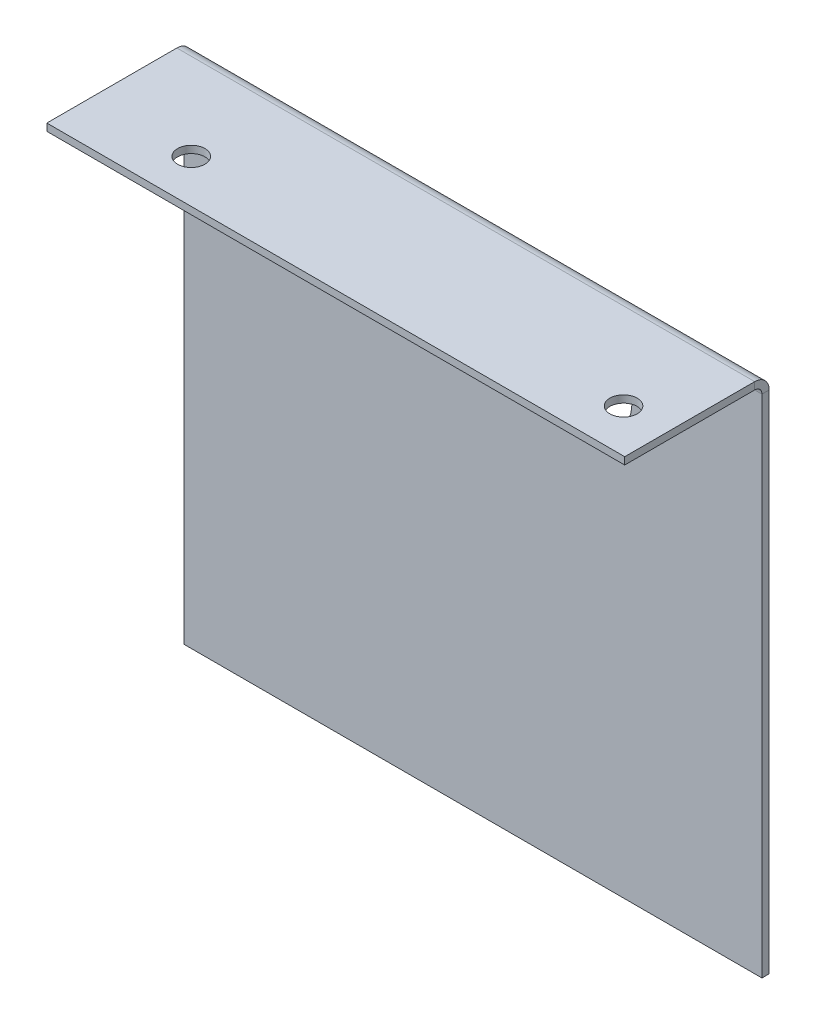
ISO-10303-21;
HEADER;
FILE_DESCRIPTION(('STEP AP214'),'2;1');
FILE_NAME('part.step','',(''),(''),'','','');
FILE_SCHEMA(('AUTOMOTIVE_DESIGN { 1 0 10303 214 1 1 1 1 }'));
ENDSEC;
DATA;
#1=APPLICATION_CONTEXT('core data for automotive mechanical design processes');
#2=APPLICATION_PROTOCOL_DEFINITION('international standard','automotive_design',2000,#1);
#3=PRODUCT_CONTEXT('',#1,'mechanical');
#4=PRODUCT('Part','Part','',(#3));
#5=PRODUCT_RELATED_PRODUCT_CATEGORY('part','',(#4));
#6=PRODUCT_DEFINITION_FORMATION('','',#4);
#7=PRODUCT_DEFINITION_CONTEXT('part definition',#1,'design');
#8=PRODUCT_DEFINITION('design','',#6,#7);
#9=PRODUCT_DEFINITION_SHAPE('','',#8);
#10=(LENGTH_UNIT() NAMED_UNIT(*) SI_UNIT(.MILLI.,.METRE.));
#11=(NAMED_UNIT(*) PLANE_ANGLE_UNIT() SI_UNIT($,.RADIAN.));
#12=(NAMED_UNIT(*) SI_UNIT($,.STERADIAN.) SOLID_ANGLE_UNIT());
#13=UNCERTAINTY_MEASURE_WITH_UNIT(LENGTH_MEASURE(1.E-05),#10,'distance_accuracy_value','');
#14=(GEOMETRIC_REPRESENTATION_CONTEXT(3) GLOBAL_UNCERTAINTY_ASSIGNED_CONTEXT((#13)) GLOBAL_UNIT_ASSIGNED_CONTEXT((#10,
#11,#12)) REPRESENTATION_CONTEXT('',''));
#15=CARTESIAN_POINT('',(0.,0.,0.));
#16=DIRECTION('',(0.,0.,1.));
#17=DIRECTION('',(1.,0.,0.));
#18=AXIS2_PLACEMENT_3D('',#15,#16,#17);
#19=CARTESIAN_POINT('',(127.,-3.175,0.));
#20=DIRECTION('',(1.,0.,0.));
#21=DIRECTION('',(0.,0.,-1.));
#22=AXIS2_PLACEMENT_3D('',#19,#20,#21);
#23=PLANE('',#22);
#24=DIRECTION('',(0.,0.,-1.));
#25=VECTOR('',#24,1.);
#26=CARTESIAN_POINT('',(127.,-3.175,0.));
#27=LINE('',#26,#25);
#28=CARTESIAN_POINT('',(127.,-3.175,63.5));
#29=VERTEX_POINT('',#28);
#30=CARTESIAN_POINT('',(127.,-3.17500000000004,6.34999999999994));
#31=VERTEX_POINT('',#30);
#32=EDGE_CURVE('E120',#29,#31,#27,.T.);
#33=ORIENTED_EDGE('',*,*,#32,.T.);
#34=DIRECTION('',(0.,1.,0.));
#35=VECTOR('',#34,1.);
#36=CARTESIAN_POINT('',(127.,-3.17500000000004,6.34999999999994));
#37=LINE('',#36,#35);
#38=CARTESIAN_POINT('',(127.,0.,6.34999999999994));
#39=VERTEX_POINT('',#38);
#40=EDGE_CURVE('E105',#31,#39,#37,.T.);
#41=ORIENTED_EDGE('',*,*,#40,.T.);
#42=DIRECTION('',(0.,0.,-1.));
#43=VECTOR('',#42,1.);
#44=CARTESIAN_POINT('',(127.,0.,0.));
#45=LINE('',#44,#43);
#46=CARTESIAN_POINT('',(127.,0.,63.5));
#47=VERTEX_POINT('',#46);
#48=EDGE_CURVE('E103',#47,#39,#45,.T.);
#49=ORIENTED_EDGE('',*,*,#48,.F.);
#50=DIRECTION('',(0.,1.,0.));
#51=VECTOR('',#50,1.);
#52=CARTESIAN_POINT('',(127.,-3.175,63.5));
#53=LINE('',#52,#51);
#54=EDGE_CURVE('E13',#29,#47,#53,.T.);
#55=ORIENTED_EDGE('',*,*,#54,.F.);
#56=EDGE_LOOP('',(#33,#41,#49,#55));
#57=FACE_BOUND('',#56,.T.);
#58=ADVANCED_FACE('F58',(#57),#23,.T.);
#59=CARTESIAN_POINT('',(0.,-3.175,0.));
#60=DIRECTION('',(0.,1.,0.));
#61=DIRECTION('',(0.,0.,1.));
#62=AXIS2_PLACEMENT_3D('',#59,#60,#61);
#63=PLANE('',#62);
#64=CARTESIAN_POINT('',(107.442,-3.175,44.45));
#65=DIRECTION('',(0.,1.,0.));
#66=DIRECTION('',(0.,0.,1.));
#67=AXIS2_PLACEMENT_3D('',#64,#65,#66);
#68=CIRCLE('',#67,6.);
#69=CARTESIAN_POINT('',(107.442,-3.175,50.45));
#70=VERTEX_POINT('',#69);
#71=EDGE_CURVE('E171',#70,#70,#68,.T.);
#72=ORIENTED_EDGE('',*,*,#71,.T.);
#73=EDGE_LOOP('',(#72));
#74=FACE_BOUND('',#73,.T.);
#75=CARTESIAN_POINT('',(-82.558,-3.175,44.45));
#76=DIRECTION('',(0.,1.,0.));
#77=DIRECTION('',(0.,0.,1.));
#78=AXIS2_PLACEMENT_3D('',#75,#76,#77);
#79=CIRCLE('',#78,6.);
#80=CARTESIAN_POINT('',(-82.558,-3.175,50.45));
#81=VERTEX_POINT('',#80);
#82=EDGE_CURVE('E115',#81,#81,#79,.T.);
#83=ORIENTED_EDGE('',*,*,#82,.T.);
#84=EDGE_LOOP('',(#83));
#85=FACE_BOUND('',#84,.T.);
#86=DIRECTION('',(1.,0.,0.));
#87=VECTOR('',#86,1.);
#88=CARTESIAN_POINT('',(127.,-3.17500000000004,6.34999999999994));
#89=LINE('',#88,#87);
#90=CARTESIAN_POINT('',(-127.,-3.175,6.34999999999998));
#91=VERTEX_POINT('',#90);
#92=EDGE_CURVE('E155',#31,#91,#89,.F.);
#93=ORIENTED_EDGE('',*,*,#92,.F.);
#94=ORIENTED_EDGE('',*,*,#32,.F.);
#95=DIRECTION('',(1.,0.,0.));
#96=VECTOR('',#95,1.);
#97=CARTESIAN_POINT('',(-127.,-3.175,63.5));
#98=LINE('',#97,#96);
#99=CARTESIAN_POINT('',(-127.,-3.175,63.5));
#100=VERTEX_POINT('',#99);
#101=EDGE_CURVE('E100',#100,#29,#98,.T.);
#102=ORIENTED_EDGE('',*,*,#101,.F.);
#103=DIRECTION('',(0.,0.,1.));
#104=VECTOR('',#103,1.);
#105=CARTESIAN_POINT('',(-127.,-3.175,0.));
#106=LINE('',#105,#104);
#107=EDGE_CURVE('E108',#91,#100,#106,.T.);
#108=ORIENTED_EDGE('',*,*,#107,.F.);
#109=EDGE_LOOP('',(#93,#94,#102,#108));
#110=FACE_BOUND('',#109,.T.);
#111=ADVANCED_FACE('F183',(#74,#85,#110),#63,.F.);
#112=CARTESIAN_POINT('',(0.,0.,0.));
#113=DIRECTION('',(0.,1.,0.));
#114=DIRECTION('',(0.,0.,1.));
#115=AXIS2_PLACEMENT_3D('',#112,#113,#114);
#116=PLANE('',#115);
#117=CARTESIAN_POINT('',(-82.558,0.,44.45));
#118=DIRECTION('',(0.,1.,0.));
#119=DIRECTION('',(0.,0.,1.));
#120=AXIS2_PLACEMENT_3D('',#117,#118,#119);
#121=CIRCLE('',#120,6.);
#122=CARTESIAN_POINT('',(-82.558,0.,50.45));
#123=VERTEX_POINT('',#122);
#124=EDGE_CURVE('E168',#123,#123,#121,.T.);
#125=ORIENTED_EDGE('',*,*,#124,.F.);
#126=EDGE_LOOP('',(#125));
#127=FACE_BOUND('',#126,.T.);
#128=CARTESIAN_POINT('',(107.442,0.,44.45));
#129=DIRECTION('',(0.,1.,0.));
#130=DIRECTION('',(0.,0.,1.));
#131=AXIS2_PLACEMENT_3D('',#128,#129,#130);
#132=CIRCLE('',#131,6.);
#133=CARTESIAN_POINT('',(107.442,0.,50.45));
#134=VERTEX_POINT('',#133);
#135=EDGE_CURVE('E164',#134,#134,#132,.T.);
#136=ORIENTED_EDGE('',*,*,#135,.F.);
#137=EDGE_LOOP('',(#136));
#138=FACE_BOUND('',#137,.T.);
#139=ORIENTED_EDGE('',*,*,#48,.T.);
#140=DIRECTION('',(1.,0.,0.));
#141=VECTOR('',#140,1.);
#142=CARTESIAN_POINT('',(127.,0.,6.34999999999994));
#143=LINE('',#142,#141);
#144=CARTESIAN_POINT('',(-127.,0.,6.34999999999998));
#145=VERTEX_POINT('',#144);
#146=EDGE_CURVE('E146',#39,#145,#143,.F.);
#147=ORIENTED_EDGE('',*,*,#146,.T.);
#148=DIRECTION('',(0.,0.,1.));
#149=VECTOR('',#148,1.);
#150=CARTESIAN_POINT('',(-127.,0.,0.));
#151=LINE('',#150,#149);
#152=CARTESIAN_POINT('',(-127.,0.,63.5));
#153=VERTEX_POINT('',#152);
#154=EDGE_CURVE('E112',#145,#153,#151,.T.);
#155=ORIENTED_EDGE('',*,*,#154,.T.);
#156=DIRECTION('',(1.,0.,0.));
#157=VECTOR('',#156,1.);
#158=CARTESIAN_POINT('',(-127.,0.,63.5));
#159=LINE('',#158,#157);
#160=EDGE_CURVE('E98',#153,#47,#159,.T.);
#161=ORIENTED_EDGE('',*,*,#160,.T.);
#162=EDGE_LOOP('',(#139,#147,#155,#161));
#163=FACE_BOUND('',#162,.T.);
#164=ADVANCED_FACE('F110',(#127,#138,#163),#116,.T.);
#165=CARTESIAN_POINT('',(-127.,-3.175,0.));
#166=DIRECTION('',(-1.,0.,0.));
#167=DIRECTION('',(0.,0.,1.));
#168=AXIS2_PLACEMENT_3D('',#165,#166,#167);
#169=PLANE('',#168);
#170=DIRECTION('',(0.,1.,0.));
#171=VECTOR('',#170,1.);
#172=CARTESIAN_POINT('',(-127.,-3.175,6.34999999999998));
#173=LINE('',#172,#171);
#174=EDGE_CURVE('E162',#91,#145,#173,.T.);
#175=ORIENTED_EDGE('',*,*,#174,.F.);
#176=ORIENTED_EDGE('',*,*,#107,.T.);
#177=DIRECTION('',(0.,1.,0.));
#178=VECTOR('',#177,1.);
#179=CARTESIAN_POINT('',(-127.,-3.175,63.5));
#180=LINE('',#179,#178);
#181=EDGE_CURVE('E67',#100,#153,#180,.T.);
#182=ORIENTED_EDGE('',*,*,#181,.T.);
#183=ORIENTED_EDGE('',*,*,#154,.F.);
#184=EDGE_LOOP('',(#175,#176,#182,#183));
#185=FACE_BOUND('',#184,.T.);
#186=ADVANCED_FACE('F60',(#185),#169,.T.);
#187=CARTESIAN_POINT('',(-127.,-3.175,63.5));
#188=DIRECTION('',(0.,0.,1.));
#189=DIRECTION('',(1.,0.,0.));
#190=AXIS2_PLACEMENT_3D('',#187,#188,#189);
#191=PLANE('',#190);
#192=ORIENTED_EDGE('',*,*,#160,.F.);
#193=ORIENTED_EDGE('',*,*,#181,.F.);
#194=ORIENTED_EDGE('',*,*,#101,.T.);
#195=ORIENTED_EDGE('',*,*,#54,.T.);
#196=EDGE_LOOP('',(#192,#193,#194,#195));
#197=FACE_BOUND('',#196,.T.);
#198=ADVANCED_FACE('F95',(#197),#191,.T.);
#199=CARTESIAN_POINT('',(107.442,-3.175,44.45));
#200=DIRECTION('',(0.,1.,0.));
#201=DIRECTION('',(0.,0.,1.));
#202=AXIS2_PLACEMENT_3D('',#199,#200,#201);
#203=CYLINDRICAL_SURFACE('',#202,6.);
#204=ORIENTED_EDGE('',*,*,#71,.F.);
#205=EDGE_LOOP('',(#204));
#206=FACE_BOUND('',#205,.T.);
#207=ORIENTED_EDGE('',*,*,#135,.T.);
#208=EDGE_LOOP('',(#207));
#209=FACE_BOUND('',#208,.T.);
#210=ADVANCED_FACE('F201',(#206,#209),#203,.F.);
#211=CARTESIAN_POINT('',(-82.558,-3.175,44.45));
#212=DIRECTION('',(0.,1.,0.));
#213=DIRECTION('',(0.,0.,1.));
#214=AXIS2_PLACEMENT_3D('',#211,#212,#213);
#215=CYLINDRICAL_SURFACE('',#214,6.);
#216=ORIENTED_EDGE('',*,*,#82,.F.);
#217=EDGE_LOOP('',(#216));
#218=FACE_BOUND('',#217,.T.);
#219=ORIENTED_EDGE('',*,*,#124,.T.);
#220=EDGE_LOOP('',(#219));
#221=FACE_BOUND('',#220,.T.);
#222=ADVANCED_FACE('F214',(#218,#221),#215,.F.);
#223=CARTESIAN_POINT('',(-127.,-6.35,6.34999999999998));
#224=DIRECTION('',(-1.,0.,0.));
#225=DIRECTION('',(0.,0.,1.));
#226=AXIS2_PLACEMENT_3D('',#223,#224,#225);
#227=PLANE('',#226);
#228=DIRECTION('',(0.,0.,1.));
#229=VECTOR('',#228,1.);
#230=CARTESIAN_POINT('',(-127.,-6.34999999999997,0.));
#231=LINE('',#230,#229);
#232=CARTESIAN_POINT('',(-127.,-6.34999999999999,3.17499999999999));
#233=VERTEX_POINT('',#232);
#234=CARTESIAN_POINT('',(-127.,-6.34999999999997,0.));
#235=VERTEX_POINT('',#234);
#236=EDGE_CURVE('E129',#233,#235,#231,.F.);
#237=ORIENTED_EDGE('',*,*,#236,.F.);
#238=CARTESIAN_POINT('',(-127.,-6.35,6.34999999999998));
#239=DIRECTION('',(1.,0.,0.));
#240=DIRECTION('',(0.,0.,-1.));
#241=AXIS2_PLACEMENT_3D('',#238,#239,#240);
#242=CIRCLE('',#241,3.17499999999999);
#243=EDGE_CURVE('E152',#91,#233,#242,.F.);
#244=ORIENTED_EDGE('',*,*,#243,.F.);
#245=ORIENTED_EDGE('',*,*,#174,.T.);
#246=CARTESIAN_POINT('',(-127.,-6.35,6.34999999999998));
#247=DIRECTION('',(1.,0.,0.));
#248=DIRECTION('',(0.,0.,-1.));
#249=AXIS2_PLACEMENT_3D('',#246,#247,#248);
#250=CIRCLE('',#249,6.34999999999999);
#251=EDGE_CURVE('E75',#145,#235,#250,.F.);
#252=ORIENTED_EDGE('',*,*,#251,.T.);
#253=EDGE_LOOP('',(#237,#244,#245,#252));
#254=FACE_BOUND('',#253,.T.);
#255=ADVANCED_FACE('F194',(#254),#227,.T.);
#256=CARTESIAN_POINT('',(127.,-6.35000000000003,6.34999999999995));
#257=DIRECTION('',(-1.,0.,0.));
#258=DIRECTION('',(0.,0.,1.));
#259=AXIS2_PLACEMENT_3D('',#256,#257,#258);
#260=PLANE('',#259);
#261=CARTESIAN_POINT('',(127.,-6.35000000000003,6.34999999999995));
#262=DIRECTION('',(1.,0.,0.));
#263=DIRECTION('',(0.,0.,-1.));
#264=AXIS2_PLACEMENT_3D('',#261,#262,#263);
#265=CIRCLE('',#264,3.17499999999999);
#266=CARTESIAN_POINT('',(127.,-6.35000000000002,3.17499999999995));
#267=VERTEX_POINT('',#266);
#268=EDGE_CURVE('E158',#267,#31,#265,.T.);
#269=ORIENTED_EDGE('',*,*,#268,.F.);
#270=DIRECTION('',(0.,0.,1.));
#271=VECTOR('',#270,1.);
#272=CARTESIAN_POINT('',(127.,-6.34999999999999,3.17499999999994));
#273=LINE('',#272,#271);
#274=CARTESIAN_POINT('',(127.,-6.34999999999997,0.));
#275=VERTEX_POINT('',#274);
#276=EDGE_CURVE('E142',#267,#275,#273,.F.);
#277=ORIENTED_EDGE('',*,*,#276,.T.);
#278=CARTESIAN_POINT('',(127.,-6.35000000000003,6.34999999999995));
#279=DIRECTION('',(1.,0.,0.));
#280=DIRECTION('',(0.,0.,-1.));
#281=AXIS2_PLACEMENT_3D('',#278,#279,#280);
#282=CIRCLE('',#281,6.34999999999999);
#283=EDGE_CURVE('E148',#275,#39,#282,.T.);
#284=ORIENTED_EDGE('',*,*,#283,.T.);
#285=ORIENTED_EDGE('',*,*,#40,.F.);
#286=EDGE_LOOP('',(#269,#277,#284,#285));
#287=FACE_BOUND('',#286,.T.);
#288=ADVANCED_FACE('F219',(#287),#260,.F.);
#289=CARTESIAN_POINT('',(127.,-6.35000000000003,6.34999999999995));
#290=DIRECTION('',(1.,0.,0.));
#291=DIRECTION('',(0.,0.,-1.));
#292=AXIS2_PLACEMENT_3D('',#289,#290,#291);
#293=CYLINDRICAL_SURFACE('',#292,6.34999999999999);
#294=ORIENTED_EDGE('',*,*,#146,.F.);
#295=ORIENTED_EDGE('',*,*,#283,.F.);
#296=DIRECTION('',(1.,0.,0.));
#297=VECTOR('',#296,1.);
#298=CARTESIAN_POINT('',(-127.,-6.34999999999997,0.));
#299=LINE('',#298,#297);
#300=EDGE_CURVE('E292',#275,#235,#299,.F.);
#301=ORIENTED_EDGE('',*,*,#300,.T.);
#302=ORIENTED_EDGE('',*,*,#251,.F.);
#303=EDGE_LOOP('',(#294,#295,#301,#302));
#304=FACE_BOUND('',#303,.T.);
#305=ADVANCED_FACE('F222',(#304),#293,.T.);
#306=CARTESIAN_POINT('',(127.,-6.35000000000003,6.34999999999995));
#307=DIRECTION('',(1.,0.,0.));
#308=DIRECTION('',(0.,0.,-1.));
#309=AXIS2_PLACEMENT_3D('',#306,#307,#308);
#310=CYLINDRICAL_SURFACE('',#309,3.17499999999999);
#311=ORIENTED_EDGE('',*,*,#92,.T.);
#312=ORIENTED_EDGE('',*,*,#243,.T.);
#313=DIRECTION('',(1.,0.,0.));
#314=VECTOR('',#313,1.);
#315=CARTESIAN_POINT('',(-127.,-6.34999999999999,3.17499999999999));
#316=LINE('',#315,#314);
#317=EDGE_CURVE('E133',#233,#267,#316,.T.);
#318=ORIENTED_EDGE('',*,*,#317,.T.);
#319=ORIENTED_EDGE('',*,*,#268,.T.);
#320=EDGE_LOOP('',(#311,#312,#318,#319));
#321=FACE_BOUND('',#320,.T.);
#322=ADVANCED_FACE('F187',(#321),#310,.F.);
#323=CARTESIAN_POINT('',(127.,-228.6,-8.33534630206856E-13));
#324=DIRECTION('',(-1.,0.,0.));
#325=DIRECTION('',(0.,0.,1.));
#326=AXIS2_PLACEMENT_3D('',#323,#324,#325);
#327=PLANE('',#326);
#328=ORIENTED_EDGE('',*,*,#276,.F.);
#329=DIRECTION('',(0.,1.,0.));
#330=VECTOR('',#329,1.);
#331=CARTESIAN_POINT('',(127.,-228.6,3.17499999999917));
#332=LINE('',#331,#330);
#333=CARTESIAN_POINT('',(127.,-228.6,3.17499999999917));
#334=VERTEX_POINT('',#333);
#335=EDGE_CURVE('E289',#267,#334,#332,.F.);
#336=ORIENTED_EDGE('',*,*,#335,.T.);
#337=DIRECTION('',(0.,0.,1.));
#338=VECTOR('',#337,1.);
#339=CARTESIAN_POINT('',(127.,-228.6,-8.3378982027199E-13));
#340=LINE('',#339,#338);
#341=CARTESIAN_POINT('',(127.,-228.6,-8.33625219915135E-13));
#342=VERTEX_POINT('',#341);
#343=EDGE_CURVE('E161',#342,#334,#340,.T.);
#344=ORIENTED_EDGE('',*,*,#343,.F.);
#345=DIRECTION('',(0.,-1.,0.));
#346=VECTOR('',#345,1.);
#347=CARTESIAN_POINT('',(127.,0.,0.));
#348=LINE('',#347,#346);
#349=EDGE_CURVE('E281',#275,#342,#348,.T.);
#350=ORIENTED_EDGE('',*,*,#349,.F.);
#351=EDGE_LOOP('',(#328,#336,#344,#350));
#352=FACE_BOUND('',#351,.T.);
#353=ADVANCED_FACE('F228',(#352),#327,.F.);
#354=CARTESIAN_POINT('',(-127.,-3.17499999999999,0.));
#355=DIRECTION('',(1.,0.,0.));
#356=DIRECTION('',(0.,0.,-1.));
#357=AXIS2_PLACEMENT_3D('',#354,#355,#356);
#358=PLANE('',#357);
#359=ORIENTED_EDGE('',*,*,#236,.T.);
#360=DIRECTION('',(0.,1.,0.));
#361=VECTOR('',#360,1.);
#362=CARTESIAN_POINT('',(-127.,0.,0.));
#363=LINE('',#362,#361);
#364=CARTESIAN_POINT('',(-127.,-228.6,-7.86966176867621E-13));
#365=VERTEX_POINT('',#364);
#366=EDGE_CURVE('E276',#365,#235,#363,.T.);
#367=ORIENTED_EDGE('',*,*,#366,.F.);
#368=DIRECTION('',(0.,0.,1.));
#369=VECTOR('',#368,1.);
#370=CARTESIAN_POINT('',(-127.,-228.6,-7.87067180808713E-13));
#371=LINE('',#370,#369);
#372=CARTESIAN_POINT('',(-127.,-228.6,3.17499999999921));
#373=VERTEX_POINT('',#372);
#374=EDGE_CURVE('E273',#365,#373,#371,.T.);
#375=ORIENTED_EDGE('',*,*,#374,.T.);
#376=DIRECTION('',(0.,-1.,0.));
#377=VECTOR('',#376,1.);
#378=CARTESIAN_POINT('',(-127.,-3.175,3.175));
#379=LINE('',#378,#377);
#380=EDGE_CURVE('E284',#373,#233,#379,.F.);
#381=ORIENTED_EDGE('',*,*,#380,.T.);
#382=EDGE_LOOP('',(#359,#367,#375,#381));
#383=FACE_BOUND('',#382,.T.);
#384=ADVANCED_FACE('F233',(#383),#358,.F.);
#385=CARTESIAN_POINT('',(0.,0.,0.));
#386=DIRECTION('',(0.,0.,1.));
#387=DIRECTION('',(0.,-1.,0.));
#388=AXIS2_PLACEMENT_3D('',#385,#386,#387);
#389=PLANE('',#388);
#390=CARTESIAN_POINT('',(-50.8,-38.1,-8.33534630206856E-13));
#391=DIRECTION('',(0.,0.,1.));
#392=DIRECTION('',(1.,0.,0.));
#393=AXIS2_PLACEMENT_3D('',#390,#391,#392);
#394=CIRCLE('',#393,19.05);
#395=CARTESIAN_POINT('',(-31.75,-38.1,-8.33534630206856E-13));
#396=VERTEX_POINT('',#395);
#397=EDGE_CURVE('E124',#396,#396,#394,.T.);
#398=ORIENTED_EDGE('',*,*,#397,.T.);
#399=EDGE_LOOP('',(#398));
#400=FACE_BOUND('',#399,.T.);
#401=CARTESIAN_POINT('',(0.,-38.1,-8.33534630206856E-13));
#402=DIRECTION('',(0.,0.,1.));
#403=DIRECTION('',(1.,0.,0.));
#404=AXIS2_PLACEMENT_3D('',#401,#402,#403);
#405=CIRCLE('',#404,19.05);
#406=CARTESIAN_POINT('',(19.05,-38.1,-8.33534630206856E-13));
#407=VERTEX_POINT('',#406);
#408=EDGE_CURVE('E263',#407,#407,#405,.T.);
#409=ORIENTED_EDGE('',*,*,#408,.T.);
#410=EDGE_LOOP('',(#409));
#411=FACE_BOUND('',#410,.T.);
#412=CARTESIAN_POINT('',(50.8,-38.1,-8.33534630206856E-13));
#413=DIRECTION('',(0.,0.,1.));
#414=DIRECTION('',(1.,0.,0.));
#415=AXIS2_PLACEMENT_3D('',#412,#413,#414);
#416=CIRCLE('',#415,19.05);
#417=CARTESIAN_POINT('',(69.85,-38.1,-8.33534630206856E-13));
#418=VERTEX_POINT('',#417);
#419=EDGE_CURVE('E266',#418,#418,#416,.T.);
#420=ORIENTED_EDGE('',*,*,#419,.T.);
#421=EDGE_LOOP('',(#420));
#422=FACE_BOUND('',#421,.T.);
#423=ORIENTED_EDGE('',*,*,#300,.F.);
#424=ORIENTED_EDGE('',*,*,#349,.T.);
#425=DIRECTION('',(-1.,0.,0.));
#426=VECTOR('',#425,1.);
#427=CARTESIAN_POINT('',(0.,-228.6,-8.10295698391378E-13));
#428=LINE('',#427,#426);
#429=EDGE_CURVE('E278',#342,#365,#428,.T.);
#430=ORIENTED_EDGE('',*,*,#429,.T.);
#431=ORIENTED_EDGE('',*,*,#366,.T.);
#432=EDGE_LOOP('',(#423,#424,#430,#431));
#433=FACE_BOUND('',#432,.T.);
#434=ADVANCED_FACE('F243',(#400,#411,#422,#433),#389,.F.);
#435=CARTESIAN_POINT('',(0.,0.,3.17499999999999));
#436=DIRECTION('',(0.,0.,1.));
#437=DIRECTION('',(0.,-1.,0.));
#438=AXIS2_PLACEMENT_3D('',#435,#436,#437);
#439=PLANE('',#438);
#440=CARTESIAN_POINT('',(-50.8,-38.1,3.17499999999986));
#441=DIRECTION('',(0.,0.,1.));
#442=DIRECTION('',(0.,-1.,0.));
#443=AXIS2_PLACEMENT_3D('',#440,#441,#442);
#444=CIRCLE('',#443,19.05);
#445=CARTESIAN_POINT('',(-50.8,-57.15,3.1749999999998));
#446=VERTEX_POINT('',#445);
#447=EDGE_CURVE('E62',#446,#446,#444,.T.);
#448=ORIENTED_EDGE('',*,*,#447,.F.);
#449=EDGE_LOOP('',(#448));
#450=FACE_BOUND('',#449,.T.);
#451=CARTESIAN_POINT('',(0.,-38.1,3.17499999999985));
#452=DIRECTION('',(0.,0.,1.));
#453=DIRECTION('',(0.,-1.,0.));
#454=AXIS2_PLACEMENT_3D('',#451,#452,#453);
#455=CIRCLE('',#454,19.05);
#456=CARTESIAN_POINT('',(0.,-57.15,3.17499999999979));
#457=VERTEX_POINT('',#456);
#458=EDGE_CURVE('E123',#457,#457,#455,.T.);
#459=ORIENTED_EDGE('',*,*,#458,.F.);
#460=EDGE_LOOP('',(#459));
#461=FACE_BOUND('',#460,.T.);
#462=CARTESIAN_POINT('',(50.8,-38.1,3.17499999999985));
#463=DIRECTION('',(0.,0.,1.));
#464=DIRECTION('',(0.,-1.,0.));
#465=AXIS2_PLACEMENT_3D('',#462,#463,#464);
#466=CIRCLE('',#465,19.05);
#467=CARTESIAN_POINT('',(50.8,-57.15,3.17499999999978));
#468=VERTEX_POINT('',#467);
#469=EDGE_CURVE('E121',#468,#468,#466,.T.);
#470=ORIENTED_EDGE('',*,*,#469,.F.);
#471=EDGE_LOOP('',(#470));
#472=FACE_BOUND('',#471,.T.);
#473=ORIENTED_EDGE('',*,*,#335,.F.);
#474=ORIENTED_EDGE('',*,*,#317,.F.);
#475=ORIENTED_EDGE('',*,*,#380,.F.);
#476=DIRECTION('',(1.,0.,0.));
#477=VECTOR('',#476,1.);
#478=CARTESIAN_POINT('',(-127.,-228.6,3.17499999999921));
#479=LINE('',#478,#477);
#480=EDGE_CURVE('E286',#334,#373,#479,.F.);
#481=ORIENTED_EDGE('',*,*,#480,.F.);
#482=EDGE_LOOP('',(#473,#474,#475,#481));
#483=FACE_BOUND('',#482,.T.);
#484=ADVANCED_FACE('F239',(#450,#461,#472,#483),#439,.T.);
#485=CARTESIAN_POINT('',(-127.,-228.6,-7.87130777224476E-13));
#486=DIRECTION('',(0.,1.,0.));
#487=DIRECTION('',(0.,0.,1.));
#488=AXIS2_PLACEMENT_3D('',#485,#486,#487);
#489=PLANE('',#488);
#490=ORIENTED_EDGE('',*,*,#480,.T.);
#491=ORIENTED_EDGE('',*,*,#374,.F.);
#492=ORIENTED_EDGE('',*,*,#429,.F.);
#493=ORIENTED_EDGE('',*,*,#343,.T.);
#494=EDGE_LOOP('',(#490,#491,#492,#493));
#495=FACE_BOUND('',#494,.T.);
#496=ADVANCED_FACE('F235',(#495),#489,.F.);
#497=CARTESIAN_POINT('',(50.8,-38.1,-8.33534630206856E-13));
#498=DIRECTION('',(0.,0.,1.));
#499=DIRECTION('',(1.,0.,0.));
#500=AXIS2_PLACEMENT_3D('',#497,#498,#499);
#501=CYLINDRICAL_SURFACE('',#500,19.05);
#502=ORIENTED_EDGE('',*,*,#469,.T.);
#503=EDGE_LOOP('',(#502));
#504=FACE_BOUND('',#503,.T.);
#505=ORIENTED_EDGE('',*,*,#419,.F.);
#506=EDGE_LOOP('',(#505));
#507=FACE_BOUND('',#506,.T.);
#508=ADVANCED_FACE('F238',(#504,#507),#501,.F.);
#509=CARTESIAN_POINT('',(0.,-38.1,-8.33534630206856E-13));
#510=DIRECTION('',(0.,0.,1.));
#511=DIRECTION('',(1.,0.,0.));
#512=AXIS2_PLACEMENT_3D('',#509,#510,#511);
#513=CYLINDRICAL_SURFACE('',#512,19.05);
#514=ORIENTED_EDGE('',*,*,#458,.T.);
#515=EDGE_LOOP('',(#514));
#516=FACE_BOUND('',#515,.T.);
#517=ORIENTED_EDGE('',*,*,#408,.F.);
#518=EDGE_LOOP('',(#517));
#519=FACE_BOUND('',#518,.T.);
#520=ADVANCED_FACE('F252',(#516,#519),#513,.F.);
#521=CARTESIAN_POINT('',(-50.8,-38.1,-8.33534630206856E-13));
#522=DIRECTION('',(0.,0.,1.));
#523=DIRECTION('',(1.,0.,0.));
#524=AXIS2_PLACEMENT_3D('',#521,#522,#523);
#525=CYLINDRICAL_SURFACE('',#524,19.05);
#526=ORIENTED_EDGE('',*,*,#447,.T.);
#527=EDGE_LOOP('',(#526));
#528=FACE_BOUND('',#527,.T.);
#529=ORIENTED_EDGE('',*,*,#397,.F.);
#530=EDGE_LOOP('',(#529));
#531=FACE_BOUND('',#530,.T.);
#532=ADVANCED_FACE('F256',(#528,#531),#525,.F.);
#533=CLOSED_SHELL('',(#58,#111,#164,#186,#198,#210,#222,#255,#288,#305,#322,#353,#384,#434,#484,
#496,#508,#520,#532));
#534=MANIFOLD_SOLID_BREP('B2',#533);
#535=ADVANCED_BREP_SHAPE_REPRESENTATION('',(#18,#534),#14);
#536=SHAPE_DEFINITION_REPRESENTATION(#9,#535);
ENDSEC;
END-ISO-10303-21;
